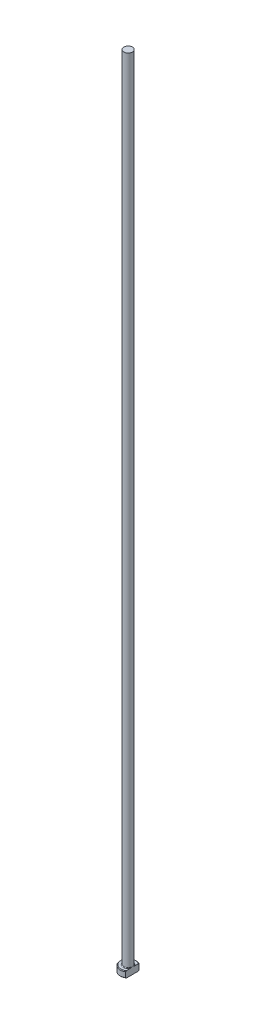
from build123d import *
from build123d.topology import SkipClean

# Parameters (mm, degrees)
CHAMFER1_SIZE = 0.2
FILLET1_R     = 0.2
KEY_DEPTH     = 251.02499875


with BuildPart() as part:
    # Sketch1 → Revolve1 (revolve)
    with BuildSketch(Plane.XY, mode=Mode.PRIVATE) as revolve1_sk:
        Polygon((0, 0), (-2.5, 0), (-2.5, 2), (-1.35, 2), (-1.35, 250), (0, 250), align=None)
    revolve(revolve1_sk.sketch.rotate(Axis((0, 259.958771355, 0), (0, -1, 0)), 270), axis=Axis((0, 259.958771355, 0), (0, -1, 0)))

    # Chamfer1
    chamfer1_edges = [part.edges().sort_by_distance(p)[0] for p in [
        (0, 2, -2.5),
        (0, 0, -2.5),
    ]]
    chamfer(chamfer1_edges, length=CHAMFER1_SIZE)

    # Fillet1
    fillet1_edges = [part.edges().sort_by_distance(p)[0] for p in [
        (0, 2, -1.35),
    ]]
    fillet(fillet1_edges, radius=FILLET1_R)

    # Sketch2 → KEY (cut, through all)
    with SkipClean():  # the faces are left unmerged after this step: merging them gives an invalid solid
        with BuildSketch(Plane(origin=(0, 0, 0), x_dir=(1, 0, 0), z_dir=(0, 1, 0))):
            with BuildLine():
                Line((1.35, 2.104162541), (1.35, -2.104162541))
                ThreePointArc((1.35, -2.104162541), (2.5, 0), (1.35, 2.104162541))
            make_face()
        extrude(amount=KEY_DEPTH, mode=Mode.SUBTRACT)


solid = part.part
